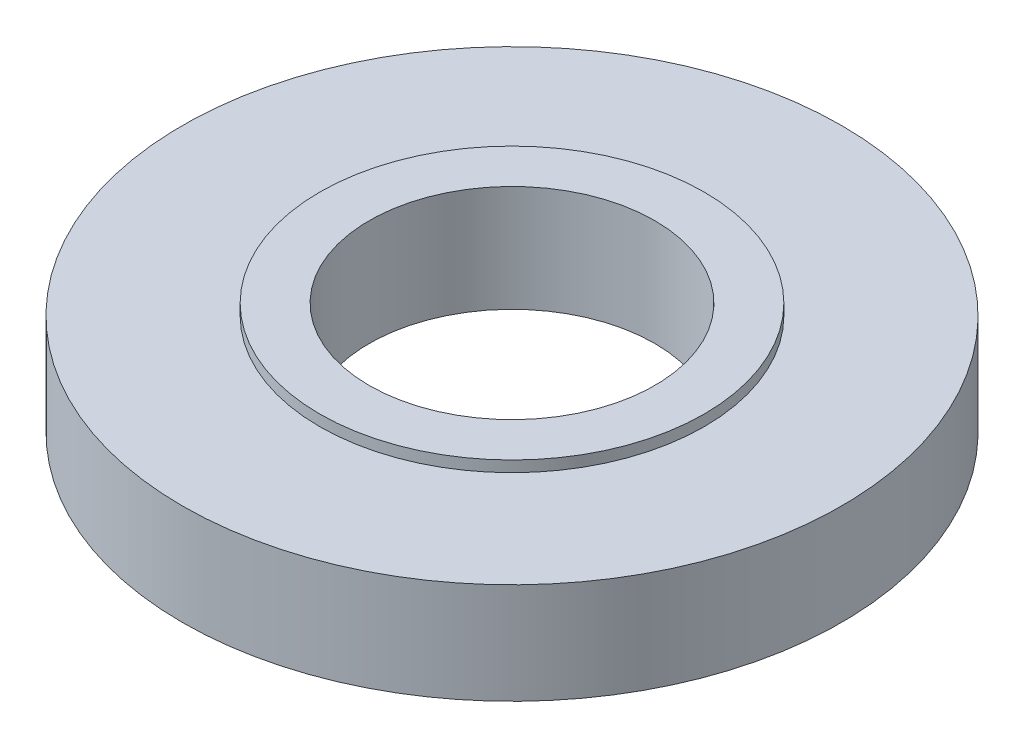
ISO-10303-21;
HEADER;
FILE_DESCRIPTION(('STEP AP214'),'2;1');
FILE_NAME('part.step','',(''),(''),'','','');
FILE_SCHEMA(('AUTOMOTIVE_DESIGN { 1 0 10303 214 1 1 1 1 }'));
ENDSEC;
DATA;
#1=APPLICATION_CONTEXT('core data for automotive mechanical design processes');
#2=APPLICATION_PROTOCOL_DEFINITION('international standard','automotive_design',2000,#1);
#3=PRODUCT_CONTEXT('',#1,'mechanical');
#4=PRODUCT('Part','Part','',(#3));
#5=PRODUCT_RELATED_PRODUCT_CATEGORY('part','',(#4));
#6=PRODUCT_DEFINITION_FORMATION('','',#4);
#7=PRODUCT_DEFINITION_CONTEXT('part definition',#1,'design');
#8=PRODUCT_DEFINITION('design','',#6,#7);
#9=PRODUCT_DEFINITION_SHAPE('','',#8);
#10=(LENGTH_UNIT() NAMED_UNIT(*) SI_UNIT(.MILLI.,.METRE.));
#11=(NAMED_UNIT(*) PLANE_ANGLE_UNIT() SI_UNIT($,.RADIAN.));
#12=(NAMED_UNIT(*) SI_UNIT($,.STERADIAN.) SOLID_ANGLE_UNIT());
#13=UNCERTAINTY_MEASURE_WITH_UNIT(LENGTH_MEASURE(1.E-05),#10,'distance_accuracy_value','');
#14=(GEOMETRIC_REPRESENTATION_CONTEXT(3) GLOBAL_UNCERTAINTY_ASSIGNED_CONTEXT((#13)) GLOBAL_UNIT_ASSIGNED_CONTEXT((#10,
#11,#12)) REPRESENTATION_CONTEXT('',''));
#15=CARTESIAN_POINT('',(0.,0.,0.));
#16=DIRECTION('',(0.,0.,1.));
#17=DIRECTION('',(1.,0.,0.));
#18=AXIS2_PLACEMENT_3D('',#15,#16,#17);
#19=CARTESIAN_POINT('',(17.5,9.68755640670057,0.));
#20=DIRECTION('',(0.,-1.,0.));
#21=DIRECTION('',(0.,0.,-1.));
#22=AXIS2_PLACEMENT_3D('',#19,#20,#21);
#23=PLANE('',#22);
#24=CARTESIAN_POINT('',(0.,9.68755640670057,0.));
#25=DIRECTION('',(0.,1.,0.));
#26=DIRECTION('',(0.,0.,1.));
#27=AXIS2_PLACEMENT_3D('',#24,#25,#26);
#28=CIRCLE('',#27,13.);
#29=CARTESIAN_POINT('',(0.,9.68755640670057,13.));
#30=VERTEX_POINT('',#29);
#31=EDGE_CURVE('E10',#30,#30,#28,.T.);
#32=ORIENTED_EDGE('',*,*,#31,.F.);
#33=EDGE_LOOP('',(#32));
#34=FACE_BOUND('',#33,.T.);
#35=CARTESIAN_POINT('',(0.,9.68755640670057,0.));
#36=DIRECTION('',(0.,1.,0.));
#37=DIRECTION('',(0.,0.,1.));
#38=AXIS2_PLACEMENT_3D('',#35,#36,#37);
#39=CIRCLE('',#38,17.5);
#40=CARTESIAN_POINT('',(0.,9.68755640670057,17.5));
#41=VERTEX_POINT('',#40);
#42=EDGE_CURVE('E82',#41,#41,#39,.T.);
#43=ORIENTED_EDGE('',*,*,#42,.T.);
#44=EDGE_LOOP('',(#43));
#45=FACE_BOUND('',#44,.T.);
#46=ADVANCED_FACE('F39',(#34,#45),#23,.F.);
#47=CARTESIAN_POINT('',(0.,46.8918953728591,0.));
#48=DIRECTION('',(0.,1.,0.));
#49=DIRECTION('',(0.,0.,1.));
#50=AXIS2_PLACEMENT_3D('',#47,#48,#49);
#51=CYLINDRICAL_SURFACE('',#50,13.);
#52=CARTESIAN_POINT('',(0.,0.,0.));
#53=DIRECTION('',(0.,1.,0.));
#54=DIRECTION('',(0.,0.,1.));
#55=AXIS2_PLACEMENT_3D('',#52,#53,#54);
#56=CIRCLE('',#55,13.);
#57=CARTESIAN_POINT('',(0.,0.,13.));
#58=VERTEX_POINT('',#57);
#59=EDGE_CURVE('E46',#58,#58,#56,.T.);
#60=ORIENTED_EDGE('',*,*,#59,.F.);
#61=EDGE_LOOP('',(#60));
#62=FACE_BOUND('',#61,.T.);
#63=ORIENTED_EDGE('',*,*,#31,.T.);
#64=EDGE_LOOP('',(#63));
#65=FACE_BOUND('',#64,.T.);
#66=ADVANCED_FACE('F132',(#62,#65),#51,.F.);
#67=CARTESIAN_POINT('',(17.5,0.,0.));
#68=DIRECTION('',(0.,1.,0.));
#69=DIRECTION('',(0.,0.,1.));
#70=AXIS2_PLACEMENT_3D('',#67,#68,#69);
#71=PLANE('',#70);
#72=CARTESIAN_POINT('',(0.,0.,0.));
#73=DIRECTION('',(0.,1.,0.));
#74=DIRECTION('',(0.,0.,1.));
#75=AXIS2_PLACEMENT_3D('',#72,#73,#74);
#76=CIRCLE('',#75,17.5);
#77=CARTESIAN_POINT('',(0.,0.,17.5));
#78=VERTEX_POINT('',#77);
#79=EDGE_CURVE('E51',#78,#78,#76,.T.);
#80=ORIENTED_EDGE('',*,*,#79,.F.);
#81=EDGE_LOOP('',(#80));
#82=FACE_BOUND('',#81,.T.);
#83=ORIENTED_EDGE('',*,*,#59,.T.);
#84=EDGE_LOOP('',(#83));
#85=FACE_BOUND('',#84,.T.);
#86=ADVANCED_FACE('F127',(#82,#85),#71,.F.);
#87=CARTESIAN_POINT('',(0.,46.8918953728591,0.));
#88=DIRECTION('',(0.,1.,0.));
#89=DIRECTION('',(0.,0.,1.));
#90=AXIS2_PLACEMENT_3D('',#87,#88,#89);
#91=CYLINDRICAL_SURFACE('',#90,17.5);
#92=CARTESIAN_POINT('',(0.,0.5,0.));
#93=DIRECTION('',(0.,1.,0.));
#94=DIRECTION('',(0.,0.,1.));
#95=AXIS2_PLACEMENT_3D('',#92,#93,#94);
#96=CIRCLE('',#95,17.5);
#97=CARTESIAN_POINT('',(0.,0.5,17.5));
#98=VERTEX_POINT('',#97);
#99=EDGE_CURVE('E56',#98,#98,#96,.T.);
#100=ORIENTED_EDGE('',*,*,#99,.F.);
#101=EDGE_LOOP('',(#100));
#102=FACE_BOUND('',#101,.T.);
#103=ORIENTED_EDGE('',*,*,#79,.T.);
#104=EDGE_LOOP('',(#103));
#105=FACE_BOUND('',#104,.T.);
#106=ADVANCED_FACE('F121',(#102,#105),#91,.T.);
#107=CARTESIAN_POINT('',(25.5,0.5,0.));
#108=DIRECTION('',(0.,1.,0.));
#109=DIRECTION('',(0.,0.,1.));
#110=AXIS2_PLACEMENT_3D('',#107,#108,#109);
#111=PLANE('',#110);
#112=CARTESIAN_POINT('',(0.,0.5,0.));
#113=DIRECTION('',(0.,1.,0.));
#114=DIRECTION('',(0.,0.,1.));
#115=AXIS2_PLACEMENT_3D('',#112,#113,#114);
#116=CIRCLE('',#115,25.5);
#117=CARTESIAN_POINT('',(0.,0.5,25.5));
#118=VERTEX_POINT('',#117);
#119=EDGE_CURVE('E62',#118,#118,#116,.T.);
#120=ORIENTED_EDGE('',*,*,#119,.F.);
#121=EDGE_LOOP('',(#120));
#122=FACE_BOUND('',#121,.T.);
#123=ORIENTED_EDGE('',*,*,#99,.T.);
#124=EDGE_LOOP('',(#123));
#125=FACE_BOUND('',#124,.T.);
#126=ADVANCED_FACE('F115',(#122,#125),#111,.F.);
#127=CARTESIAN_POINT('',(0.,46.8918953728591,0.));
#128=DIRECTION('',(0.,1.,0.));
#129=DIRECTION('',(0.,0.,1.));
#130=AXIS2_PLACEMENT_3D('',#127,#128,#129);
#131=CYLINDRICAL_SURFACE('',#130,25.5);
#132=CARTESIAN_POINT('',(0.,-0.5,0.));
#133=DIRECTION('',(0.,1.,0.));
#134=DIRECTION('',(0.,0.,1.));
#135=AXIS2_PLACEMENT_3D('',#132,#133,#134);
#136=CIRCLE('',#135,25.5);
#137=CARTESIAN_POINT('',(0.,-0.5,25.5));
#138=VERTEX_POINT('',#137);
#139=EDGE_CURVE('E66',#138,#138,#136,.T.);
#140=ORIENTED_EDGE('',*,*,#139,.F.);
#141=EDGE_LOOP('',(#140));
#142=FACE_BOUND('',#141,.T.);
#143=ORIENTED_EDGE('',*,*,#119,.T.);
#144=EDGE_LOOP('',(#143));
#145=FACE_BOUND('',#144,.T.);
#146=ADVANCED_FACE('F109',(#142,#145),#131,.F.);
#147=CARTESIAN_POINT('',(30.,-0.499999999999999,0.));
#148=DIRECTION('',(0.,1.,0.));
#149=DIRECTION('',(0.,0.,1.));
#150=AXIS2_PLACEMENT_3D('',#147,#148,#149);
#151=PLANE('',#150);
#152=CARTESIAN_POINT('',(0.,-0.5,0.));
#153=DIRECTION('',(0.,1.,0.));
#154=DIRECTION('',(0.,0.,1.));
#155=AXIS2_PLACEMENT_3D('',#152,#153,#154);
#156=CIRCLE('',#155,30.);
#157=CARTESIAN_POINT('',(0.,-0.5,30.));
#158=VERTEX_POINT('',#157);
#159=EDGE_CURVE('E70',#158,#158,#156,.T.);
#160=ORIENTED_EDGE('',*,*,#159,.F.);
#161=EDGE_LOOP('',(#160));
#162=FACE_BOUND('',#161,.T.);
#163=ORIENTED_EDGE('',*,*,#139,.T.);
#164=EDGE_LOOP('',(#163));
#165=FACE_BOUND('',#164,.T.);
#166=ADVANCED_FACE('F103',(#162,#165),#151,.F.);
#167=CARTESIAN_POINT('',(0.,46.8918953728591,0.));
#168=DIRECTION('',(0.,1.,0.));
#169=DIRECTION('',(0.,0.,1.));
#170=AXIS2_PLACEMENT_3D('',#167,#168,#169);
#171=CYLINDRICAL_SURFACE('',#170,30.);
#172=CARTESIAN_POINT('',(0.,8.68755640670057,0.));
#173=DIRECTION('',(0.,1.,0.));
#174=DIRECTION('',(0.,0.,1.));
#175=AXIS2_PLACEMENT_3D('',#172,#173,#174);
#176=CIRCLE('',#175,30.);
#177=CARTESIAN_POINT('',(0.,8.68755640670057,30.));
#178=VERTEX_POINT('',#177);
#179=EDGE_CURVE('E74',#178,#178,#176,.T.);
#180=ORIENTED_EDGE('',*,*,#179,.F.);
#181=EDGE_LOOP('',(#180));
#182=FACE_BOUND('',#181,.T.);
#183=ORIENTED_EDGE('',*,*,#159,.T.);
#184=EDGE_LOOP('',(#183));
#185=FACE_BOUND('',#184,.T.);
#186=ADVANCED_FACE('F97',(#182,#185),#171,.T.);
#187=CARTESIAN_POINT('',(17.5,8.68755640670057,0.));
#188=DIRECTION('',(0.,-1.,0.));
#189=DIRECTION('',(0.,0.,-1.));
#190=AXIS2_PLACEMENT_3D('',#187,#188,#189);
#191=PLANE('',#190);
#192=CARTESIAN_POINT('',(0.,8.68755640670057,0.));
#193=DIRECTION('',(0.,1.,0.));
#194=DIRECTION('',(0.,0.,1.));
#195=AXIS2_PLACEMENT_3D('',#192,#193,#194);
#196=CIRCLE('',#195,17.5);
#197=CARTESIAN_POINT('',(0.,8.68755640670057,17.5));
#198=VERTEX_POINT('',#197);
#199=EDGE_CURVE('E78',#198,#198,#196,.T.);
#200=ORIENTED_EDGE('',*,*,#199,.F.);
#201=EDGE_LOOP('',(#200));
#202=FACE_BOUND('',#201,.T.);
#203=ORIENTED_EDGE('',*,*,#179,.T.);
#204=EDGE_LOOP('',(#203));
#205=FACE_BOUND('',#204,.T.);
#206=ADVANCED_FACE('F91',(#202,#205),#191,.F.);
#207=CARTESIAN_POINT('',(0.,46.8918953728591,0.));
#208=DIRECTION('',(0.,1.,0.));
#209=DIRECTION('',(0.,0.,1.));
#210=AXIS2_PLACEMENT_3D('',#207,#208,#209);
#211=CYLINDRICAL_SURFACE('',#210,17.5);
#212=ORIENTED_EDGE('',*,*,#42,.F.);
#213=EDGE_LOOP('',(#212));
#214=FACE_BOUND('',#213,.T.);
#215=ORIENTED_EDGE('',*,*,#199,.T.);
#216=EDGE_LOOP('',(#215));
#217=FACE_BOUND('',#216,.T.);
#218=ADVANCED_FACE('F88',(#214,#217),#211,.T.);
#219=CLOSED_SHELL('',(#46,#66,#86,#106,#126,#146,#166,#186,#206,#218));
#220=MANIFOLD_SOLID_BREP('B2',#219);
#221=ADVANCED_BREP_SHAPE_REPRESENTATION('',(#18,#220),#14);
#222=SHAPE_DEFINITION_REPRESENTATION(#9,#221);
ENDSEC;
END-ISO-10303-21;
